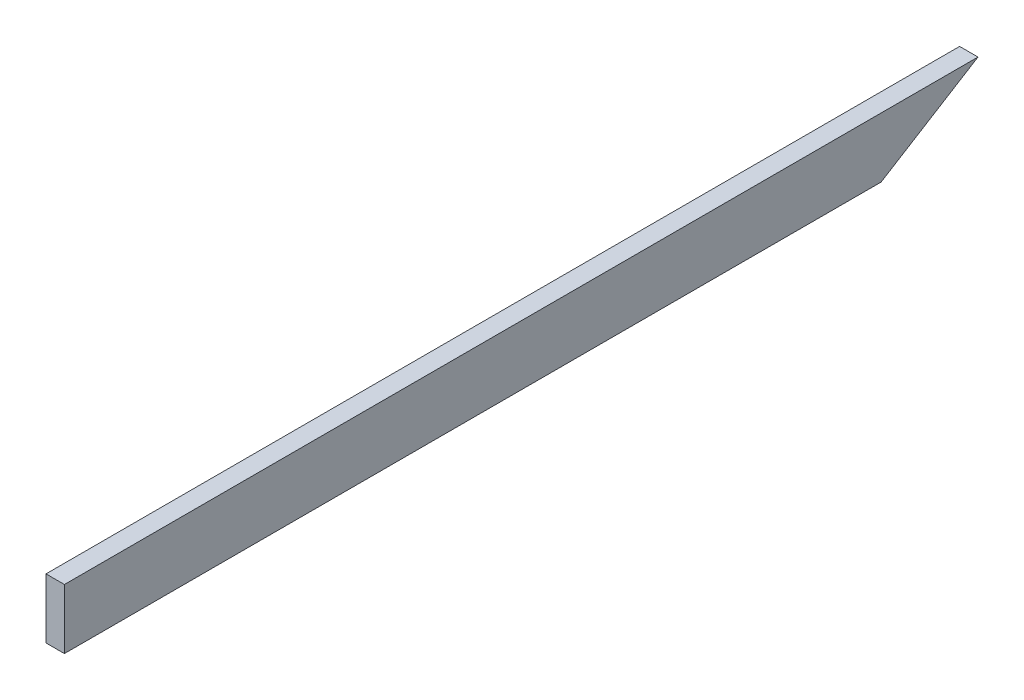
ISO-10303-21;
HEADER;
FILE_DESCRIPTION(('STEP AP214'),'2;1');
FILE_NAME('part.step','',(''),(''),'','','');
FILE_SCHEMA(('AUTOMOTIVE_DESIGN { 1 0 10303 214 1 1 1 1 }'));
ENDSEC;
DATA;
#1=APPLICATION_CONTEXT('core data for automotive mechanical design processes');
#2=APPLICATION_PROTOCOL_DEFINITION('international standard','automotive_design',2000,#1);
#3=PRODUCT_CONTEXT('',#1,'mechanical');
#4=PRODUCT('Part','Part','',(#3));
#5=PRODUCT_RELATED_PRODUCT_CATEGORY('part','',(#4));
#6=PRODUCT_DEFINITION_FORMATION('','',#4);
#7=PRODUCT_DEFINITION_CONTEXT('part definition',#1,'design');
#8=PRODUCT_DEFINITION('design','',#6,#7);
#9=PRODUCT_DEFINITION_SHAPE('','',#8);
#10=(LENGTH_UNIT() NAMED_UNIT(*) SI_UNIT(.MILLI.,.METRE.));
#11=(NAMED_UNIT(*) PLANE_ANGLE_UNIT() SI_UNIT($,.RADIAN.));
#12=(NAMED_UNIT(*) SI_UNIT($,.STERADIAN.) SOLID_ANGLE_UNIT());
#13=UNCERTAINTY_MEASURE_WITH_UNIT(LENGTH_MEASURE(1.E-05),#10,'distance_accuracy_value','');
#14=(GEOMETRIC_REPRESENTATION_CONTEXT(3) GLOBAL_UNCERTAINTY_ASSIGNED_CONTEXT((#13)) GLOBAL_UNIT_ASSIGNED_CONTEXT((#10,
#11,#12)) REPRESENTATION_CONTEXT('',''));
#15=CARTESIAN_POINT('',(0.,0.,0.));
#16=DIRECTION('',(0.,0.,1.));
#17=DIRECTION('',(1.,0.,0.));
#18=AXIS2_PLACEMENT_3D('',#15,#16,#17);
#19=CARTESIAN_POINT('',(-2.,6.5,150.));
#20=DIRECTION('',(1.,0.,0.));
#21=DIRECTION('',(0.,0.,-1.));
#22=AXIS2_PLACEMENT_3D('',#19,#20,#21);
#23=PLANE('',#22);
#24=DIRECTION('',(0.,0.,-1.));
#25=VECTOR('',#24,1.);
#26=CARTESIAN_POINT('',(-2.,6.5,150.));
#27=LINE('',#26,#25);
#28=CARTESIAN_POINT('',(-2.,6.5,150.));
#29=VERTEX_POINT('',#28);
#30=CARTESIAN_POINT('',(-2.,6.5,-48.4484605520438));
#31=VERTEX_POINT('',#30);
#32=EDGE_CURVE('E84',#29,#31,#27,.T.);
#33=ORIENTED_EDGE('',*,*,#32,.T.);
#34=DIRECTION('',(0.,-0.525492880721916,0.850797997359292));
#35=VECTOR('',#34,1.);
#36=CARTESIAN_POINT('',(-2.,-82.2239829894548,95.1998928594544));
#37=LINE('',#36,#35);
#38=CARTESIAN_POINT('',(-2.,-6.5,-27.4008415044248));
#39=VERTEX_POINT('',#38);
#40=EDGE_CURVE('E41',#31,#39,#37,.T.);
#41=ORIENTED_EDGE('',*,*,#40,.T.);
#42=DIRECTION('',(0.,0.,-1.));
#43=VECTOR('',#42,1.);
#44=CARTESIAN_POINT('',(-2.,-6.5,150.));
#45=LINE('',#44,#43);
#46=CARTESIAN_POINT('',(-2.,-6.5,150.));
#47=VERTEX_POINT('',#46);
#48=EDGE_CURVE('E11',#47,#39,#45,.T.);
#49=ORIENTED_EDGE('',*,*,#48,.F.);
#50=DIRECTION('',(0.,-1.,0.));
#51=VECTOR('',#50,1.);
#52=CARTESIAN_POINT('',(-2.,6.5,150.));
#53=LINE('',#52,#51);
#54=EDGE_CURVE('E93',#29,#47,#53,.T.);
#55=ORIENTED_EDGE('',*,*,#54,.F.);
#56=EDGE_LOOP('',(#33,#41,#49,#55));
#57=FACE_BOUND('',#56,.T.);
#58=ADVANCED_FACE('F27',(#57),#23,.F.);
#59=CARTESIAN_POINT('',(-2.,-6.5,150.));
#60=DIRECTION('',(0.,1.,0.));
#61=DIRECTION('',(0.,0.,1.));
#62=AXIS2_PLACEMENT_3D('',#59,#60,#61);
#63=PLANE('',#62);
#64=ORIENTED_EDGE('',*,*,#48,.T.);
#65=DIRECTION('',(1.,0.,0.));
#66=VECTOR('',#65,1.);
#67=CARTESIAN_POINT('',(-8.,-6.5,-27.4008415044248));
#68=LINE('',#67,#66);
#69=CARTESIAN_POINT('',(2.,-6.5,-27.4008415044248));
#70=VERTEX_POINT('',#69);
#71=EDGE_CURVE('E73',#39,#70,#68,.T.);
#72=ORIENTED_EDGE('',*,*,#71,.T.);
#73=DIRECTION('',(0.,0.,-1.));
#74=VECTOR('',#73,1.);
#75=CARTESIAN_POINT('',(2.,-6.5,150.));
#76=LINE('',#75,#74);
#77=CARTESIAN_POINT('',(2.,-6.5,150.));
#78=VERTEX_POINT('',#77);
#79=EDGE_CURVE('E34',#78,#70,#76,.T.);
#80=ORIENTED_EDGE('',*,*,#79,.F.);
#81=DIRECTION('',(1.,0.,0.));
#82=VECTOR('',#81,1.);
#83=CARTESIAN_POINT('',(-2.,-6.5,150.));
#84=LINE('',#83,#82);
#85=EDGE_CURVE('E91',#47,#78,#84,.T.);
#86=ORIENTED_EDGE('',*,*,#85,.F.);
#87=EDGE_LOOP('',(#64,#72,#80,#86));
#88=FACE_BOUND('',#87,.T.);
#89=ADVANCED_FACE('F97',(#88),#63,.F.);
#90=CARTESIAN_POINT('',(2.,6.5,150.));
#91=DIRECTION('',(-1.,0.,0.));
#92=DIRECTION('',(0.,0.,1.));
#93=AXIS2_PLACEMENT_3D('',#90,#91,#92);
#94=PLANE('',#93);
#95=ORIENTED_EDGE('',*,*,#79,.T.);
#96=DIRECTION('',(0.,-0.525492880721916,0.850797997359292));
#97=VECTOR('',#96,1.);
#98=CARTESIAN_POINT('',(2.,-6.5,-27.4008415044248));
#99=LINE('',#98,#97);
#100=CARTESIAN_POINT('',(2.,6.5,-48.4484605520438));
#101=VERTEX_POINT('',#100);
#102=EDGE_CURVE('E68',#101,#70,#99,.T.);
#103=ORIENTED_EDGE('',*,*,#102,.F.);
#104=DIRECTION('',(0.,0.,-1.));
#105=VECTOR('',#104,1.);
#106=CARTESIAN_POINT('',(2.,6.5,150.));
#107=LINE('',#106,#105);
#108=CARTESIAN_POINT('',(2.,6.5,150.));
#109=VERTEX_POINT('',#108);
#110=EDGE_CURVE('E80',#109,#101,#107,.T.);
#111=ORIENTED_EDGE('',*,*,#110,.F.);
#112=DIRECTION('',(0.,1.,0.));
#113=VECTOR('',#112,1.);
#114=CARTESIAN_POINT('',(2.,6.5,150.));
#115=LINE('',#114,#113);
#116=EDGE_CURVE('E89',#78,#109,#115,.T.);
#117=ORIENTED_EDGE('',*,*,#116,.F.);
#118=EDGE_LOOP('',(#95,#103,#111,#117));
#119=FACE_BOUND('',#118,.T.);
#120=ADVANCED_FACE('F78',(#119),#94,.F.);
#121=CARTESIAN_POINT('',(-2.,6.5,150.));
#122=DIRECTION('',(0.,-1.,0.));
#123=DIRECTION('',(0.,0.,-1.));
#124=AXIS2_PLACEMENT_3D('',#121,#122,#123);
#125=PLANE('',#124);
#126=ORIENTED_EDGE('',*,*,#110,.T.);
#127=DIRECTION('',(1.,0.,0.));
#128=VECTOR('',#127,1.);
#129=CARTESIAN_POINT('',(-8.,6.5,-48.4484605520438));
#130=LINE('',#129,#128);
#131=EDGE_CURVE('E65',#31,#101,#130,.T.);
#132=ORIENTED_EDGE('',*,*,#131,.F.);
#133=ORIENTED_EDGE('',*,*,#32,.F.);
#134=DIRECTION('',(-1.,0.,0.));
#135=VECTOR('',#134,1.);
#136=CARTESIAN_POINT('',(-2.,6.5,150.));
#137=LINE('',#136,#135);
#138=EDGE_CURVE('E49',#109,#29,#137,.T.);
#139=ORIENTED_EDGE('',*,*,#138,.F.);
#140=EDGE_LOOP('',(#126,#132,#133,#139));
#141=FACE_BOUND('',#140,.T.);
#142=ADVANCED_FACE('F83',(#141),#125,.F.);
#143=CARTESIAN_POINT('',(-2.,-6.5,150.));
#144=DIRECTION('',(0.,0.,1.));
#145=DIRECTION('',(1.,0.,0.));
#146=AXIS2_PLACEMENT_3D('',#143,#144,#145);
#147=PLANE('',#146);
#148=ORIENTED_EDGE('',*,*,#54,.T.);
#149=ORIENTED_EDGE('',*,*,#85,.T.);
#150=ORIENTED_EDGE('',*,*,#116,.T.);
#151=ORIENTED_EDGE('',*,*,#138,.T.);
#152=EDGE_LOOP('',(#148,#149,#150,#151));
#153=FACE_BOUND('',#152,.T.);
#154=ADVANCED_FACE('F101',(#153),#147,.T.);
#155=CARTESIAN_POINT('',(-8.,-6.5,-27.4008415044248));
#156=DIRECTION('',(0.,0.850797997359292,0.525492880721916));
#157=DIRECTION('',(0.,-0.525492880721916,0.850797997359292));
#158=AXIS2_PLACEMENT_3D('',#155,#156,#157);
#159=PLANE('',#158);
#160=ORIENTED_EDGE('',*,*,#131,.T.);
#161=ORIENTED_EDGE('',*,*,#102,.T.);
#162=ORIENTED_EDGE('',*,*,#71,.F.);
#163=ORIENTED_EDGE('',*,*,#40,.F.);
#164=EDGE_LOOP('',(#160,#161,#162,#163));
#165=FACE_BOUND('',#164,.T.);
#166=ADVANCED_FACE('F67',(#165),#159,.F.);
#167=CLOSED_SHELL('',(#58,#89,#120,#142,#154,#166));
#168=MANIFOLD_SOLID_BREP('B2',#167);
#169=ADVANCED_BREP_SHAPE_REPRESENTATION('',(#18,#168),#14);
#170=SHAPE_DEFINITION_REPRESENTATION(#9,#169);
ENDSEC;
END-ISO-10303-21;
